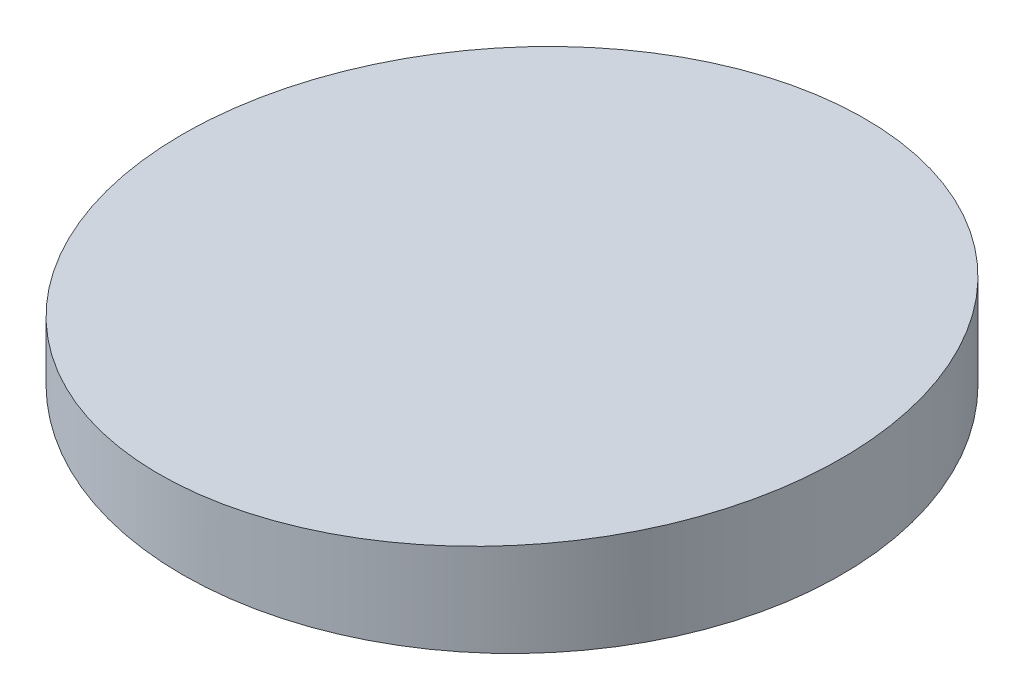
ISO-10303-21;
HEADER;
FILE_DESCRIPTION(('STEP AP214'),'2;1');
FILE_NAME('part.step','',(''),(''),'','','');
FILE_SCHEMA(('AUTOMOTIVE_DESIGN { 1 0 10303 214 1 1 1 1 }'));
ENDSEC;
DATA;
#1=APPLICATION_CONTEXT('core data for automotive mechanical design processes');
#2=APPLICATION_PROTOCOL_DEFINITION('international standard','automotive_design',2000,#1);
#3=PRODUCT_CONTEXT('',#1,'mechanical');
#4=PRODUCT('Part','Part','',(#3));
#5=PRODUCT_RELATED_PRODUCT_CATEGORY('part','',(#4));
#6=PRODUCT_DEFINITION_FORMATION('','',#4);
#7=PRODUCT_DEFINITION_CONTEXT('part definition',#1,'design');
#8=PRODUCT_DEFINITION('design','',#6,#7);
#9=PRODUCT_DEFINITION_SHAPE('','',#8);
#10=(LENGTH_UNIT() NAMED_UNIT(*) SI_UNIT(.MILLI.,.METRE.));
#11=(NAMED_UNIT(*) PLANE_ANGLE_UNIT() SI_UNIT($,.RADIAN.));
#12=(NAMED_UNIT(*) SI_UNIT($,.STERADIAN.) SOLID_ANGLE_UNIT());
#13=UNCERTAINTY_MEASURE_WITH_UNIT(LENGTH_MEASURE(1.E-05),#10,'distance_accuracy_value','');
#14=(GEOMETRIC_REPRESENTATION_CONTEXT(3) GLOBAL_UNCERTAINTY_ASSIGNED_CONTEXT((#13)) GLOBAL_UNIT_ASSIGNED_CONTEXT((#10,
#11,#12)) REPRESENTATION_CONTEXT('',''));
#15=CARTESIAN_POINT('',(0.,0.,0.));
#16=DIRECTION('',(0.,0.,1.));
#17=DIRECTION('',(1.,0.,0.));
#18=AXIS2_PLACEMENT_3D('',#15,#16,#17);
#19=CARTESIAN_POINT('',(0.,15.5194,0.));
#20=DIRECTION('',(0.,-1.,0.));
#21=DIRECTION('',(0.,0.,-1.));
#22=AXIS2_PLACEMENT_3D('',#19,#20,#21);
#23=CYLINDRICAL_SURFACE('',#22,50.8);
#24=CARTESIAN_POINT('',(0.,0.,0.));
#25=DIRECTION('',(0.,1.,0.));
#26=DIRECTION('',(0.,0.,1.));
#27=AXIS2_PLACEMENT_3D('',#24,#25,#26);
#28=CIRCLE('',#27,50.8);
#29=CARTESIAN_POINT('',(0.,0.,50.8));
#30=VERTEX_POINT('',#29);
#31=EDGE_CURVE('E10',#30,#30,#28,.T.);
#32=ORIENTED_EDGE('',*,*,#31,.T.);
#33=EDGE_LOOP('',(#32));
#34=FACE_BOUND('',#33,.T.);
#35=CARTESIAN_POINT('',(0.,11.7621379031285,0.));
#36=DIRECTION('',(-0.0737603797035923,0.997275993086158,0.));
#37=DIRECTION('',(-0.997275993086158,-0.0737603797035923,0.));
#38=AXIS2_PLACEMENT_3D('',#35,#36,#37);
#39=ELLIPSE('',#38,50.9387575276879,50.8);
#40=CARTESIAN_POINT('',(-50.8,8.00487580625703,0.));
#41=VERTEX_POINT('',#40);
#42=EDGE_CURVE('E40',#41,#41,#39,.T.);
#43=ORIENTED_EDGE('',*,*,#42,.F.);
#44=EDGE_LOOP('',(#43));
#45=FACE_BOUND('',#44,.T.);
#46=ADVANCED_FACE('F34',(#34,#45),#23,.T.);
#47=CARTESIAN_POINT('',(0.,0.,0.));
#48=DIRECTION('',(0.,1.,0.));
#49=DIRECTION('',(0.,0.,1.));
#50=AXIS2_PLACEMENT_3D('',#47,#48,#49);
#51=PLANE('',#50);
#52=ORIENTED_EDGE('',*,*,#31,.F.);
#53=EDGE_LOOP('',(#52));
#54=FACE_BOUND('',#53,.T.);
#55=ADVANCED_FACE('F49',(#54),#51,.F.);
#56=CARTESIAN_POINT('',(50.8,15.5194,-244.149746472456));
#57=DIRECTION('',(-0.0737603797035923,0.997275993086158,0.));
#58=DIRECTION('',(-0.997275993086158,-0.0737603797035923,0.));
#59=AXIS2_PLACEMENT_3D('',#56,#57,#58);
#60=PLANE('',#59);
#61=ORIENTED_EDGE('',*,*,#42,.T.);
#62=EDGE_LOOP('',(#61));
#63=FACE_BOUND('',#62,.T.);
#64=ADVANCED_FACE('F46',(#63),#60,.T.);
#65=CLOSED_SHELL('',(#46,#55,#64));
#66=MANIFOLD_SOLID_BREP('B2',#65);
#67=ADVANCED_BREP_SHAPE_REPRESENTATION('',(#18,#66),#14);
#68=SHAPE_DEFINITION_REPRESENTATION(#9,#67);
ENDSEC;
END-ISO-10303-21;
